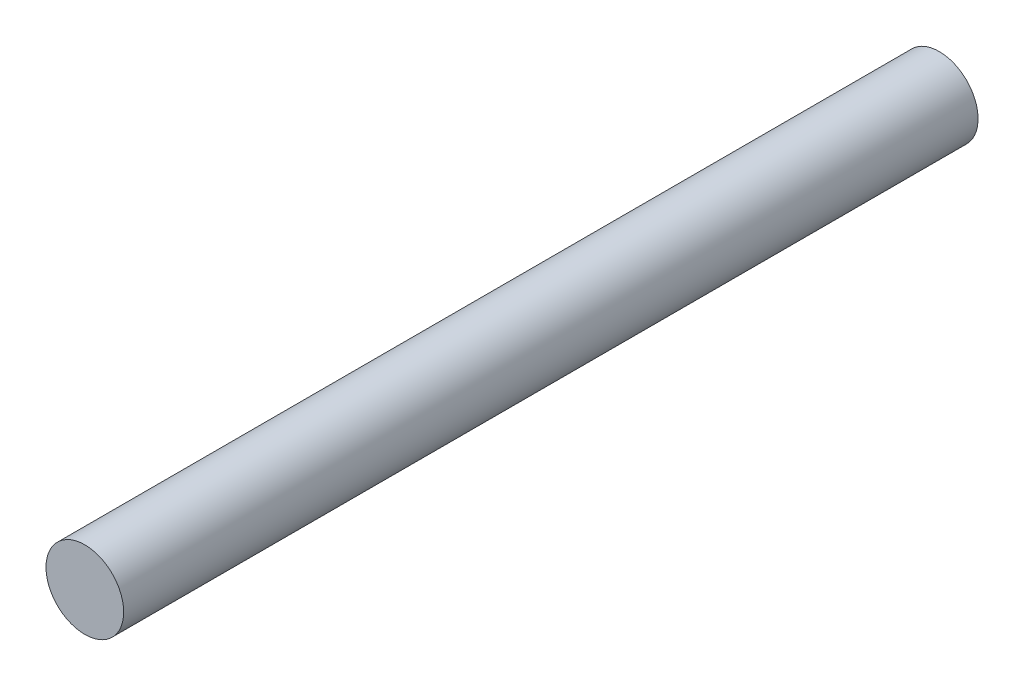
ISO-10303-21;
HEADER;
FILE_DESCRIPTION(('STEP AP214'),'2;1');
FILE_NAME('part.step','',(''),(''),'','','');
FILE_SCHEMA(('AUTOMOTIVE_DESIGN { 1 0 10303 214 1 1 1 1 }'));
ENDSEC;
DATA;
#1=APPLICATION_CONTEXT('core data for automotive mechanical design processes');
#2=APPLICATION_PROTOCOL_DEFINITION('international standard','automotive_design',2000,#1);
#3=PRODUCT_CONTEXT('',#1,'mechanical');
#4=PRODUCT('Part','Part','',(#3));
#5=PRODUCT_RELATED_PRODUCT_CATEGORY('part','',(#4));
#6=PRODUCT_DEFINITION_FORMATION('','',#4);
#7=PRODUCT_DEFINITION_CONTEXT('part definition',#1,'design');
#8=PRODUCT_DEFINITION('design','',#6,#7);
#9=PRODUCT_DEFINITION_SHAPE('','',#8);
#10=(LENGTH_UNIT() NAMED_UNIT(*) SI_UNIT(.MILLI.,.METRE.));
#11=(NAMED_UNIT(*) PLANE_ANGLE_UNIT() SI_UNIT($,.RADIAN.));
#12=(NAMED_UNIT(*) SI_UNIT($,.STERADIAN.) SOLID_ANGLE_UNIT());
#13=UNCERTAINTY_MEASURE_WITH_UNIT(LENGTH_MEASURE(1.E-05),#10,'distance_accuracy_value','');
#14=(GEOMETRIC_REPRESENTATION_CONTEXT(3) GLOBAL_UNCERTAINTY_ASSIGNED_CONTEXT((#13)) GLOBAL_UNIT_ASSIGNED_CONTEXT((#10,
#11,#12)) REPRESENTATION_CONTEXT('',''));
#15=CARTESIAN_POINT('',(0.,0.,0.));
#16=DIRECTION('',(0.,0.,1.));
#17=DIRECTION('',(1.,0.,0.));
#18=AXIS2_PLACEMENT_3D('',#15,#16,#17);
#19=CARTESIAN_POINT('',(-3.036,-3.036,0.));
#20=DIRECTION('',(0.,0.,1.));
#21=DIRECTION('',(1.,0.,0.));
#22=AXIS2_PLACEMENT_3D('',#19,#20,#21);
#23=PLANE('',#22);
#24=CARTESIAN_POINT('',(0.,0.,0.));
#25=DIRECTION('',(0.,0.,-1.));
#26=DIRECTION('',(-1.,0.,0.));
#27=AXIS2_PLACEMENT_3D('',#24,#25,#26);
#28=CIRCLE('',#27,3.);
#29=CARTESIAN_POINT('',(-3.,0.,0.));
#30=VERTEX_POINT('',#29);
#31=EDGE_CURVE('E8',#30,#30,#28,.T.);
#32=ORIENTED_EDGE('',*,*,#31,.T.);
#33=EDGE_LOOP('',(#32));
#34=FACE_BOUND('',#33,.T.);
#35=ADVANCED_FACE('F12',(#34),#23,.F.);
#36=CARTESIAN_POINT('',(0.,0.,64.));
#37=DIRECTION('',(0.,0.,-1.));
#38=DIRECTION('',(-1.,0.,0.));
#39=AXIS2_PLACEMENT_3D('',#36,#37,#38);
#40=CYLINDRICAL_SURFACE('',#39,3.);
#41=ORIENTED_EDGE('',*,*,#31,.F.);
#42=EDGE_LOOP('',(#41));
#43=FACE_BOUND('',#42,.T.);
#44=CARTESIAN_POINT('',(0.,0.,66.));
#45=DIRECTION('',(0.,0.,1.));
#46=DIRECTION('',(1.,0.,0.));
#47=AXIS2_PLACEMENT_3D('',#44,#45,#46);
#48=CIRCLE('',#47,3.);
#49=CARTESIAN_POINT('',(3.,0.,66.));
#50=VERTEX_POINT('',#49);
#51=EDGE_CURVE('E18',#50,#50,#48,.T.);
#52=ORIENTED_EDGE('',*,*,#51,.F.);
#53=EDGE_LOOP('',(#52));
#54=FACE_BOUND('',#53,.T.);
#55=ADVANCED_FACE('F26',(#43,#54),#40,.T.);
#56=CARTESIAN_POINT('',(0.,0.,66.));
#57=DIRECTION('',(0.,0.,1.));
#58=DIRECTION('',(1.,0.,0.));
#59=AXIS2_PLACEMENT_3D('',#56,#57,#58);
#60=PLANE('',#59);
#61=ORIENTED_EDGE('',*,*,#51,.T.);
#62=EDGE_LOOP('',(#61));
#63=FACE_BOUND('',#62,.T.);
#64=ADVANCED_FACE('F24',(#63),#60,.T.);
#65=CLOSED_SHELL('',(#35,#55,#64));
#66=MANIFOLD_SOLID_BREP('B1',#65);
#67=ADVANCED_BREP_SHAPE_REPRESENTATION('',(#18,#66),#14);
#68=SHAPE_DEFINITION_REPRESENTATION(#9,#67);
ENDSEC;
END-ISO-10303-21;
